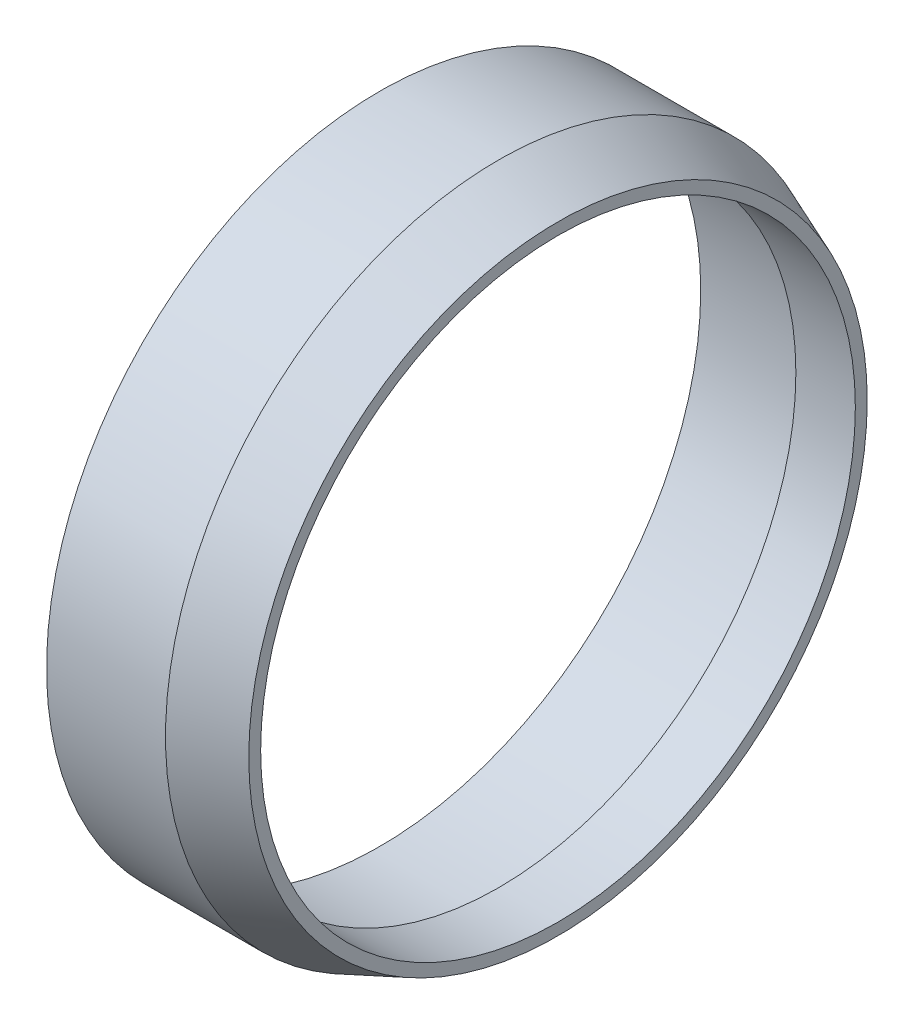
ISO-10303-21;
HEADER;
FILE_DESCRIPTION(('STEP AP214'),'2;1');
FILE_NAME('part.step','',(''),(''),'','','');
FILE_SCHEMA(('AUTOMOTIVE_DESIGN { 1 0 10303 214 1 1 1 1 }'));
ENDSEC;
DATA;
#1=APPLICATION_CONTEXT('core data for automotive mechanical design processes');
#2=APPLICATION_PROTOCOL_DEFINITION('international standard','automotive_design',2000,#1);
#3=PRODUCT_CONTEXT('',#1,'mechanical');
#4=PRODUCT('Part','Part','',(#3));
#5=PRODUCT_RELATED_PRODUCT_CATEGORY('part','',(#4));
#6=PRODUCT_DEFINITION_FORMATION('','',#4);
#7=PRODUCT_DEFINITION_CONTEXT('part definition',#1,'design');
#8=PRODUCT_DEFINITION('design','',#6,#7);
#9=PRODUCT_DEFINITION_SHAPE('','',#8);
#10=(LENGTH_UNIT() NAMED_UNIT(*) SI_UNIT(.MILLI.,.METRE.));
#11=(NAMED_UNIT(*) PLANE_ANGLE_UNIT() SI_UNIT($,.RADIAN.));
#12=(NAMED_UNIT(*) SI_UNIT($,.STERADIAN.) SOLID_ANGLE_UNIT());
#13=UNCERTAINTY_MEASURE_WITH_UNIT(LENGTH_MEASURE(1.E-05),#10,'distance_accuracy_value','');
#14=(GEOMETRIC_REPRESENTATION_CONTEXT(3) GLOBAL_UNCERTAINTY_ASSIGNED_CONTEXT((#13)) GLOBAL_UNIT_ASSIGNED_CONTEXT((#10,
#11,#12)) REPRESENTATION_CONTEXT('',''));
#15=CARTESIAN_POINT('',(0.,0.,0.));
#16=DIRECTION('',(0.,0.,1.));
#17=DIRECTION('',(1.,0.,0.));
#18=AXIS2_PLACEMENT_3D('',#15,#16,#17);
#19=CARTESIAN_POINT('',(37.9005030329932,0.,0.));
#20=DIRECTION('',(1.,0.,0.));
#21=DIRECTION('',(0.,0.,-1.));
#22=AXIS2_PLACEMENT_3D('',#19,#20,#21);
#23=CYLINDRICAL_SURFACE('',#22,25.);
#24=CARTESIAN_POINT('',(0.,0.,0.));
#25=DIRECTION('',(1.,0.,0.));
#26=DIRECTION('',(0.,0.,-1.));
#27=AXIS2_PLACEMENT_3D('',#24,#25,#26);
#28=CIRCLE('',#27,25.);
#29=CARTESIAN_POINT('',(0.,0.,-25.));
#30=VERTEX_POINT('',#29);
#31=EDGE_CURVE('E10',#30,#30,#28,.T.);
#32=ORIENTED_EDGE('',*,*,#31,.F.);
#33=EDGE_LOOP('',(#32));
#34=FACE_BOUND('',#33,.T.);
#35=CARTESIAN_POINT('',(5.,0.,0.));
#36=DIRECTION('',(1.,0.,0.));
#37=DIRECTION('',(0.,0.,-1.));
#38=AXIS2_PLACEMENT_3D('',#35,#36,#37);
#39=CIRCLE('',#38,25.);
#40=CARTESIAN_POINT('',(5.,0.,-25.));
#41=VERTEX_POINT('',#40);
#42=EDGE_CURVE('E55',#41,#41,#39,.T.);
#43=ORIENTED_EDGE('',*,*,#42,.T.);
#44=EDGE_LOOP('',(#43));
#45=FACE_BOUND('',#44,.T.);
#46=ADVANCED_FACE('F30',(#34,#45),#23,.F.);
#47=CARTESIAN_POINT('',(0.,0.,25.));
#48=DIRECTION('',(1.,0.,0.));
#49=DIRECTION('',(0.,0.,-1.));
#50=AXIS2_PLACEMENT_3D('',#47,#48,#49);
#51=PLANE('',#50);
#52=CARTESIAN_POINT('',(0.,0.,0.));
#53=DIRECTION('',(1.,0.,0.));
#54=DIRECTION('',(0.,0.,-1.));
#55=AXIS2_PLACEMENT_3D('',#52,#53,#54);
#56=CIRCLE('',#55,27.);
#57=CARTESIAN_POINT('',(0.,0.,-27.));
#58=VERTEX_POINT('',#57);
#59=EDGE_CURVE('E36',#58,#58,#56,.T.);
#60=ORIENTED_EDGE('',*,*,#59,.F.);
#61=EDGE_LOOP('',(#60));
#62=FACE_BOUND('',#61,.T.);
#63=ORIENTED_EDGE('',*,*,#31,.T.);
#64=EDGE_LOOP('',(#63));
#65=FACE_BOUND('',#64,.T.);
#66=ADVANCED_FACE('F86',(#62,#65),#51,.F.);
#67=CARTESIAN_POINT('',(37.9005030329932,0.,0.));
#68=DIRECTION('',(1.,0.,0.));
#69=DIRECTION('',(0.,0.,-1.));
#70=AXIS2_PLACEMENT_3D('',#67,#68,#69);
#71=CYLINDRICAL_SURFACE('',#70,27.);
#72=CARTESIAN_POINT('',(-9.99999999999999,0.,0.));
#73=DIRECTION('',(1.,0.,0.));
#74=DIRECTION('',(0.,0.,-1.));
#75=AXIS2_PLACEMENT_3D('',#72,#73,#74);
#76=CIRCLE('',#75,27.);
#77=CARTESIAN_POINT('',(-9.99999999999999,0.,-27.));
#78=VERTEX_POINT('',#77);
#79=EDGE_CURVE('E40',#78,#78,#76,.T.);
#80=ORIENTED_EDGE('',*,*,#79,.F.);
#81=EDGE_LOOP('',(#80));
#82=FACE_BOUND('',#81,.T.);
#83=ORIENTED_EDGE('',*,*,#59,.T.);
#84=EDGE_LOOP('',(#83));
#85=FACE_BOUND('',#84,.T.);
#86=ADVANCED_FACE('F81',(#82,#85),#71,.F.);
#87=CARTESIAN_POINT('',(-9.99999999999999,0.,27.));
#88=DIRECTION('',(1.,0.,0.));
#89=DIRECTION('',(0.,0.,-1.));
#90=AXIS2_PLACEMENT_3D('',#87,#88,#89);
#91=PLANE('',#90);
#92=CARTESIAN_POINT('',(-9.99999999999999,0.,0.));
#93=DIRECTION('',(1.,0.,0.));
#94=DIRECTION('',(0.,0.,-1.));
#95=AXIS2_PLACEMENT_3D('',#92,#93,#94);
#96=CIRCLE('',#95,28.);
#97=CARTESIAN_POINT('',(-9.99999999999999,0.,-28.));
#98=VERTEX_POINT('',#97);
#99=EDGE_CURVE('E44',#98,#98,#96,.T.);
#100=ORIENTED_EDGE('',*,*,#99,.F.);
#101=EDGE_LOOP('',(#100));
#102=FACE_BOUND('',#101,.T.);
#103=ORIENTED_EDGE('',*,*,#79,.T.);
#104=EDGE_LOOP('',(#103));
#105=FACE_BOUND('',#104,.T.);
#106=ADVANCED_FACE('F75',(#102,#105),#91,.F.);
#107=CARTESIAN_POINT('',(37.9005030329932,0.,0.));
#108=DIRECTION('',(1.,0.,0.));
#109=DIRECTION('',(0.,0.,-1.));
#110=AXIS2_PLACEMENT_3D('',#107,#108,#109);
#111=CYLINDRICAL_SURFACE('',#110,28.);
#112=CARTESIAN_POINT('',(0.,0.,0.));
#113=DIRECTION('',(1.,0.,0.));
#114=DIRECTION('',(0.,0.,-1.));
#115=AXIS2_PLACEMENT_3D('',#112,#113,#114);
#116=CIRCLE('',#115,28.);
#117=CARTESIAN_POINT('',(0.,0.,-28.));
#118=VERTEX_POINT('',#117);
#119=EDGE_CURVE('E49',#118,#118,#116,.T.);
#120=ORIENTED_EDGE('',*,*,#119,.F.);
#121=EDGE_LOOP('',(#120));
#122=FACE_BOUND('',#121,.T.);
#123=ORIENTED_EDGE('',*,*,#99,.T.);
#124=EDGE_LOOP('',(#123));
#125=FACE_BOUND('',#124,.T.);
#126=ADVANCED_FACE('F69',(#122,#125),#111,.T.);
#127=CARTESIAN_POINT('',(0.,0.,0.));
#128=DIRECTION('',(-1.,0.,0.));
#129=DIRECTION('',(0.,0.,1.));
#130=AXIS2_PLACEMENT_3D('',#127,#128,#129);
#131=CONICAL_SURFACE('',#130,28.,0.380506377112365);
#132=CARTESIAN_POINT('',(5.,0.,0.));
#133=DIRECTION('',(1.,0.,0.));
#134=DIRECTION('',(0.,0.,-1.));
#135=AXIS2_PLACEMENT_3D('',#132,#133,#134);
#136=CIRCLE('',#135,26.);
#137=CARTESIAN_POINT('',(5.,0.,-26.));
#138=VERTEX_POINT('',#137);
#139=EDGE_CURVE('E52',#138,#138,#136,.T.);
#140=ORIENTED_EDGE('',*,*,#139,.F.);
#141=EDGE_LOOP('',(#140));
#142=FACE_BOUND('',#141,.T.);
#143=ORIENTED_EDGE('',*,*,#119,.T.);
#144=EDGE_LOOP('',(#143));
#145=FACE_BOUND('',#144,.T.);
#146=ADVANCED_FACE('F63',(#142,#145),#131,.T.);
#147=CARTESIAN_POINT('',(5.,0.,26.));
#148=DIRECTION('',(-1.,0.,0.));
#149=DIRECTION('',(0.,0.,1.));
#150=AXIS2_PLACEMENT_3D('',#147,#148,#149);
#151=PLANE('',#150);
#152=ORIENTED_EDGE('',*,*,#42,.F.);
#153=EDGE_LOOP('',(#152));
#154=FACE_BOUND('',#153,.T.);
#155=ORIENTED_EDGE('',*,*,#139,.T.);
#156=EDGE_LOOP('',(#155));
#157=FACE_BOUND('',#156,.T.);
#158=ADVANCED_FACE('F60',(#154,#157),#151,.F.);
#159=CLOSED_SHELL('',(#46,#66,#86,#106,#126,#146,#158));
#160=MANIFOLD_SOLID_BREP('B2',#159);
#161=ADVANCED_BREP_SHAPE_REPRESENTATION('',(#18,#160),#14);
#162=SHAPE_DEFINITION_REPRESENTATION(#9,#161);
ENDSEC;
END-ISO-10303-21;
